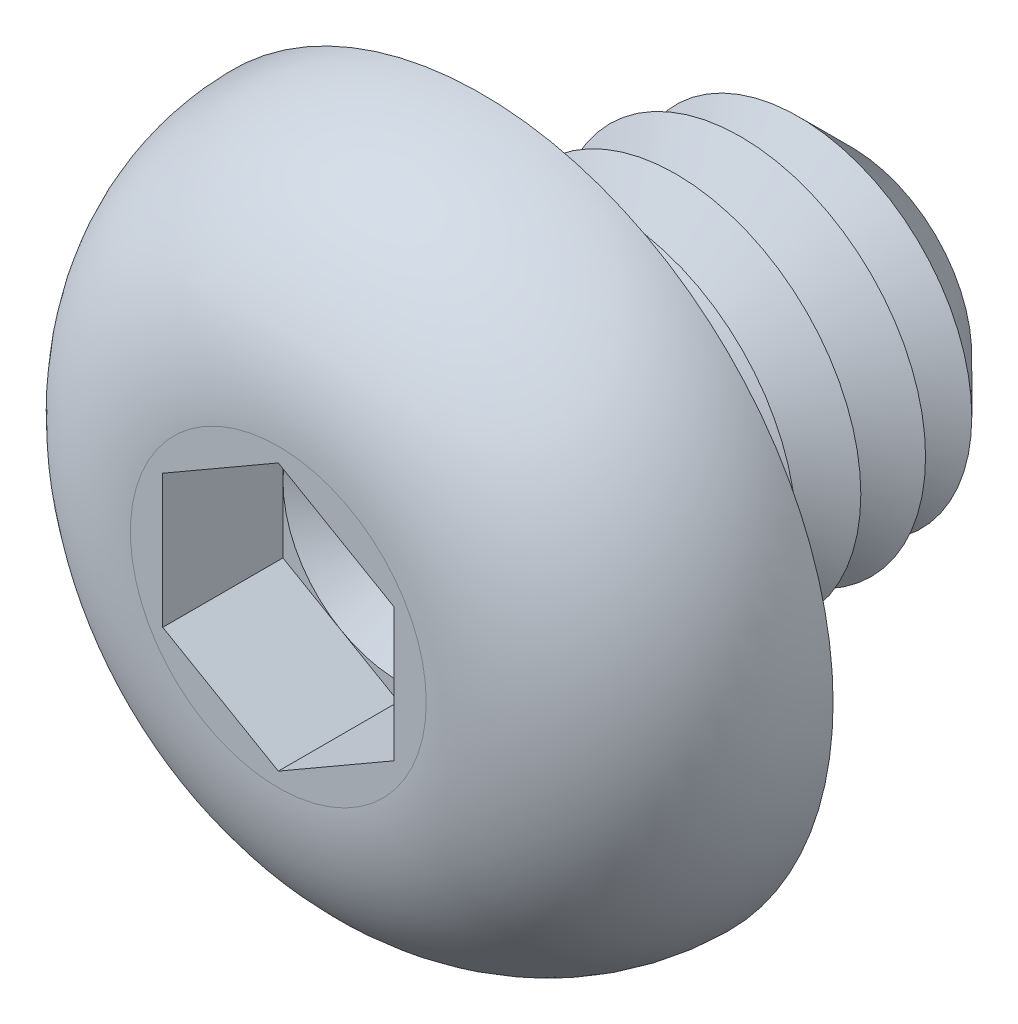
ISO-10303-21;
HEADER;
FILE_DESCRIPTION(('STEP AP214'),'2;1');
FILE_NAME('part.step','',(''),(''),'','','');
FILE_SCHEMA(('AUTOMOTIVE_DESIGN { 1 0 10303 214 1 1 1 1 }'));
ENDSEC;
DATA;
#1=APPLICATION_CONTEXT('core data for automotive mechanical design processes');
#2=APPLICATION_PROTOCOL_DEFINITION('international standard','automotive_design',2000,#1);
#3=PRODUCT_CONTEXT('',#1,'mechanical');
#4=PRODUCT('Part','Part','',(#3));
#5=PRODUCT_RELATED_PRODUCT_CATEGORY('part','',(#4));
#6=PRODUCT_DEFINITION_FORMATION('','',#4);
#7=PRODUCT_DEFINITION_CONTEXT('part definition',#1,'design');
#8=PRODUCT_DEFINITION('design','',#6,#7);
#9=PRODUCT_DEFINITION_SHAPE('','',#8);
#10=(LENGTH_UNIT() NAMED_UNIT(*) SI_UNIT(.MILLI.,.METRE.));
#11=(NAMED_UNIT(*) PLANE_ANGLE_UNIT() SI_UNIT($,.RADIAN.));
#12=(NAMED_UNIT(*) SI_UNIT($,.STERADIAN.) SOLID_ANGLE_UNIT());
#13=UNCERTAINTY_MEASURE_WITH_UNIT(LENGTH_MEASURE(1.E-05),#10,'distance_accuracy_value','');
#14=(GEOMETRIC_REPRESENTATION_CONTEXT(3) GLOBAL_UNCERTAINTY_ASSIGNED_CONTEXT((#13)) GLOBAL_UNIT_ASSIGNED_CONTEXT((#10,
#11,#12)) REPRESENTATION_CONTEXT('',''));
#15=CARTESIAN_POINT('',(0.,0.,0.));
#16=DIRECTION('',(0.,0.,1.));
#17=DIRECTION('',(1.,0.,0.));
#18=AXIS2_PLACEMENT_3D('',#15,#16,#17);
#19=CARTESIAN_POINT('',(0.,0.,0.900000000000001));
#20=DIRECTION('',(0.,0.,1.));
#21=DIRECTION('',(1.,0.,0.));
#22=AXIS2_PLACEMENT_3D('',#19,#20,#21);
#23=PLANE('',#22);
#24=CARTESIAN_POINT('',(0.,0.,0.900000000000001));
#25=DIRECTION('',(0.,0.,1.));
#26=DIRECTION('',(1.,0.,0.));
#27=AXIS2_PLACEMENT_3D('',#24,#25,#26);
#28=CIRCLE('',#27,1.25);
#29=CARTESIAN_POINT('',(1.25,0.,0.900000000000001));
#30=VERTEX_POINT('',#29);
#31=CARTESIAN_POINT('',(0.625,1.08253175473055,0.900000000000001));
#32=VERTEX_POINT('',#31);
#33=EDGE_CURVE('E117',#30,#32,#28,.T.);
#34=ORIENTED_EDGE('',*,*,#33,.F.);
#35=DIRECTION('',(0.,1.,0.));
#36=VECTOR('',#35,1.);
#37=CARTESIAN_POINT('',(1.25,-0.721687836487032,0.900000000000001));
#38=LINE('',#37,#36);
#39=CARTESIAN_POINT('',(1.25,0.721687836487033,0.900000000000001));
#40=VERTEX_POINT('',#39);
#41=EDGE_CURVE('E140',#30,#40,#38,.T.);
#42=ORIENTED_EDGE('',*,*,#41,.T.);
#43=DIRECTION('',(-0.866025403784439,0.5,0.));
#44=VECTOR('',#43,1.);
#45=CARTESIAN_POINT('',(1.25,0.721687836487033,0.900000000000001));
#46=LINE('',#45,#44);
#47=EDGE_CURVE('E135',#40,#32,#46,.T.);
#48=ORIENTED_EDGE('',*,*,#47,.T.);
#49=EDGE_LOOP('',(#34,#42,#48));
#50=FACE_BOUND('',#49,.T.);
#51=ADVANCED_FACE('F39',(#50),#23,.T.);
#52=CARTESIAN_POINT('',(0.,0.,0.900000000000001));
#53=DIRECTION('',(0.,0.,1.));
#54=DIRECTION('',(1.,0.,0.));
#55=AXIS2_PLACEMENT_3D('',#52,#53,#54);
#56=CIRCLE('',#55,1.25);
#57=CARTESIAN_POINT('',(-0.625,1.08253175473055,0.900000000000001));
#58=VERTEX_POINT('',#57);
#59=EDGE_CURVE('E11',#32,#58,#56,.T.);
#60=ORIENTED_EDGE('',*,*,#59,.F.);
#61=CARTESIAN_POINT('',(0.,1.44337567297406,0.900000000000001));
#62=VERTEX_POINT('',#61);
#63=EDGE_CURVE('E130',#32,#62,#46,.T.);
#64=ORIENTED_EDGE('',*,*,#63,.T.);
#65=DIRECTION('',(-0.866025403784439,-0.5,0.));
#66=VECTOR('',#65,1.);
#67=CARTESIAN_POINT('',(0.,1.44337567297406,0.900000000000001));
#68=LINE('',#67,#66);
#69=EDGE_CURVE('E132',#62,#58,#68,.T.);
#70=ORIENTED_EDGE('',*,*,#69,.T.);
#71=EDGE_LOOP('',(#60,#64,#70));
#72=FACE_BOUND('',#71,.T.);
#73=ADVANCED_FACE('F129',(#72),#23,.T.);
#74=CARTESIAN_POINT('',(-1.25,0.,0.900000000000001));
#75=VERTEX_POINT('',#74);
#76=EDGE_CURVE('E49',#58,#75,#56,.T.);
#77=ORIENTED_EDGE('',*,*,#76,.F.);
#78=CARTESIAN_POINT('',(-1.25,0.721687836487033,0.900000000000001));
#79=VERTEX_POINT('',#78);
#80=EDGE_CURVE('E143',#58,#79,#68,.T.);
#81=ORIENTED_EDGE('',*,*,#80,.T.);
#82=DIRECTION('',(0.,-1.,0.));
#83=VECTOR('',#82,1.);
#84=CARTESIAN_POINT('',(-1.25,0.721687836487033,0.900000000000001));
#85=LINE('',#84,#83);
#86=EDGE_CURVE('E154',#79,#75,#85,.T.);
#87=ORIENTED_EDGE('',*,*,#86,.T.);
#88=EDGE_LOOP('',(#77,#81,#87));
#89=FACE_BOUND('',#88,.T.);
#90=ADVANCED_FACE('F254',(#89),#23,.T.);
#91=CARTESIAN_POINT('',(-0.625,-1.08253175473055,0.900000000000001));
#92=VERTEX_POINT('',#91);
#93=EDGE_CURVE('E237',#75,#92,#56,.T.);
#94=ORIENTED_EDGE('',*,*,#93,.F.);
#95=CARTESIAN_POINT('',(-1.25,-0.721687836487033,0.900000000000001));
#96=VERTEX_POINT('',#95);
#97=EDGE_CURVE('E153',#75,#96,#85,.T.);
#98=ORIENTED_EDGE('',*,*,#97,.T.);
#99=DIRECTION('',(0.866025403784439,-0.5,0.));
#100=VECTOR('',#99,1.);
#101=CARTESIAN_POINT('',(-1.25,-0.721687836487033,0.900000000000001));
#102=LINE('',#101,#100);
#103=EDGE_CURVE('E159',#96,#92,#102,.T.);
#104=ORIENTED_EDGE('',*,*,#103,.T.);
#105=EDGE_LOOP('',(#94,#98,#104));
#106=FACE_BOUND('',#105,.T.);
#107=ADVANCED_FACE('F247',(#106),#23,.T.);
#108=CARTESIAN_POINT('',(0.625,-1.08253175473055,0.900000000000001));
#109=VERTEX_POINT('',#108);
#110=EDGE_CURVE('E56',#92,#109,#56,.T.);
#111=ORIENTED_EDGE('',*,*,#110,.F.);
#112=CARTESIAN_POINT('',(0.,-1.44337567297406,0.900000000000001));
#113=VERTEX_POINT('',#112);
#114=EDGE_CURVE('E158',#92,#113,#102,.T.);
#115=ORIENTED_EDGE('',*,*,#114,.T.);
#116=DIRECTION('',(0.866025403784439,0.5,0.));
#117=VECTOR('',#116,1.);
#118=CARTESIAN_POINT('',(0.,-1.44337567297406,0.900000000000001));
#119=LINE('',#118,#117);
#120=EDGE_CURVE('E164',#113,#109,#119,.T.);
#121=ORIENTED_EDGE('',*,*,#120,.T.);
#122=EDGE_LOOP('',(#111,#115,#121));
#123=FACE_BOUND('',#122,.T.);
#124=ADVANCED_FACE('F320',(#123),#23,.T.);
#125=CARTESIAN_POINT('',(0.,0.,-4.));
#126=DIRECTION('',(0.,0.,1.));
#127=DIRECTION('',(1.,0.,0.));
#128=AXIS2_PLACEMENT_3D('',#125,#126,#127);
#129=CYLINDRICAL_SURFACE('',#128,2.);
#130=CARTESIAN_POINT('',(0.,0.,-0.3));
#131=DIRECTION('',(0.,0.,1.));
#132=DIRECTION('',(1.,0.,0.));
#133=AXIS2_PLACEMENT_3D('',#130,#131,#132);
#134=CIRCLE('',#133,2.);
#135=CARTESIAN_POINT('',(2.,0.,-0.3));
#136=VERTEX_POINT('',#135);
#137=EDGE_CURVE('E222',#136,#136,#134,.F.);
#138=ORIENTED_EDGE('',*,*,#137,.T.);
#139=EDGE_LOOP('',(#138));
#140=FACE_BOUND('',#139,.T.);
#141=CARTESIAN_POINT('',(0.,0.,-0.699999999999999));
#142=DIRECTION('',(0.,0.,1.));
#143=DIRECTION('',(1.,0.,0.));
#144=AXIS2_PLACEMENT_3D('',#141,#142,#143);
#145=CIRCLE('',#144,2.);
#146=CARTESIAN_POINT('',(2.,0.,-0.699999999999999));
#147=VERTEX_POINT('',#146);
#148=EDGE_CURVE('E149',#147,#147,#145,.T.);
#149=ORIENTED_EDGE('',*,*,#148,.T.);
#150=EDGE_LOOP('',(#149));
#151=FACE_BOUND('',#150,.T.);
#152=ADVANCED_FACE('F304',(#140,#151),#129,.T.);
#153=CARTESIAN_POINT('',(0.,3.8,0.));
#154=DIRECTION('',(0.,0.,1.));
#155=DIRECTION('',(1.,0.,0.));
#156=AXIS2_PLACEMENT_3D('',#153,#154,#155);
#157=PLANE('',#156);
#158=CARTESIAN_POINT('',(0.,0.,0.));
#159=DIRECTION('',(0.,0.,1.));
#160=DIRECTION('',(1.,0.,0.));
#161=AXIS2_PLACEMENT_3D('',#158,#159,#160);
#162=CIRCLE('',#161,2.3);
#163=CARTESIAN_POINT('',(2.3,0.,0.));
#164=VERTEX_POINT('',#163);
#165=EDGE_CURVE('E230',#164,#164,#162,.T.);
#166=ORIENTED_EDGE('',*,*,#165,.T.);
#167=EDGE_LOOP('',(#166));
#168=FACE_BOUND('',#167,.T.);
#169=CARTESIAN_POINT('',(0.,0.,0.));
#170=DIRECTION('',(0.,0.,1.));
#171=DIRECTION('',(1.,0.,0.));
#172=AXIS2_PLACEMENT_3D('',#169,#170,#171);
#173=CIRCLE('',#172,3.8);
#174=CARTESIAN_POINT('',(3.8,0.,0.));
#175=VERTEX_POINT('',#174);
#176=EDGE_CURVE('E196',#175,#175,#173,.T.);
#177=ORIENTED_EDGE('',*,*,#176,.F.);
#178=EDGE_LOOP('',(#177));
#179=FACE_BOUND('',#178,.T.);
#180=ADVANCED_FACE('F350',(#168,#179),#157,.F.);
#181=CARTESIAN_POINT('',(0.,0.,2.2));
#182=DIRECTION('',(0.,0.,-1.));
#183=DIRECTION('',(-1.,0.,0.));
#184=AXIS2_PLACEMENT_3D('',#181,#182,#183);
#185=PLANE('',#184);
#186=DIRECTION('',(-0.866025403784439,-0.5,0.));
#187=VECTOR('',#186,1.);
#188=CARTESIAN_POINT('',(0.,1.44337567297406,2.2));
#189=LINE('',#188,#187);
#190=CARTESIAN_POINT('',(0.,1.44337567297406,2.2));
#191=VERTEX_POINT('',#190);
#192=CARTESIAN_POINT('',(-1.25,0.721687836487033,2.2));
#193=VERTEX_POINT('',#192);
#194=EDGE_CURVE('E174',#191,#193,#189,.T.);
#195=ORIENTED_EDGE('',*,*,#194,.F.);
#196=DIRECTION('',(-0.866025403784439,0.5,0.));
#197=VECTOR('',#196,1.);
#198=CARTESIAN_POINT('',(1.25,0.721687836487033,2.2));
#199=LINE('',#198,#197);
#200=CARTESIAN_POINT('',(1.25,0.721687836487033,2.2));
#201=VERTEX_POINT('',#200);
#202=EDGE_CURVE('E64',#201,#191,#199,.T.);
#203=ORIENTED_EDGE('',*,*,#202,.F.);
#204=DIRECTION('',(0.,1.,0.));
#205=VECTOR('',#204,1.);
#206=CARTESIAN_POINT('',(1.25,-0.721687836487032,2.2));
#207=LINE('',#206,#205);
#208=CARTESIAN_POINT('',(1.25,-0.721687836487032,2.2));
#209=VERTEX_POINT('',#208);
#210=EDGE_CURVE('E138',#209,#201,#207,.T.);
#211=ORIENTED_EDGE('',*,*,#210,.F.);
#212=DIRECTION('',(0.866025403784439,0.5,0.));
#213=VECTOR('',#212,1.);
#214=CARTESIAN_POINT('',(0.,-1.44337567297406,2.2));
#215=LINE('',#214,#213);
#216=CARTESIAN_POINT('',(0.,-1.44337567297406,2.2));
#217=VERTEX_POINT('',#216);
#218=EDGE_CURVE('E186',#217,#209,#215,.T.);
#219=ORIENTED_EDGE('',*,*,#218,.F.);
#220=DIRECTION('',(0.866025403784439,-0.5,0.));
#221=VECTOR('',#220,1.);
#222=CARTESIAN_POINT('',(-1.25,-0.721687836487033,2.2));
#223=LINE('',#222,#221);
#224=CARTESIAN_POINT('',(-1.25,-0.721687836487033,2.2));
#225=VERTEX_POINT('',#224);
#226=EDGE_CURVE('E182',#225,#217,#223,.T.);
#227=ORIENTED_EDGE('',*,*,#226,.F.);
#228=DIRECTION('',(0.,-1.,0.));
#229=VECTOR('',#228,1.);
#230=CARTESIAN_POINT('',(-1.25,0.721687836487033,2.2));
#231=LINE('',#230,#229);
#232=EDGE_CURVE('E178',#193,#225,#231,.T.);
#233=ORIENTED_EDGE('',*,*,#232,.F.);
#234=EDGE_LOOP('',(#195,#203,#211,#219,#227,#233));
#235=FACE_BOUND('',#234,.T.);
#236=CARTESIAN_POINT('',(0.,0.,2.2));
#237=DIRECTION('',(0.,0.,1.));
#238=DIRECTION('',(1.,0.,0.));
#239=AXIS2_PLACEMENT_3D('',#236,#237,#238);
#240=CIRCLE('',#239,1.6);
#241=CARTESIAN_POINT('',(1.6,0.,2.2));
#242=VERTEX_POINT('',#241);
#243=EDGE_CURVE('E214',#242,#242,#240,.T.);
#244=ORIENTED_EDGE('',*,*,#243,.T.);
#245=EDGE_LOOP('',(#244));
#246=FACE_BOUND('',#245,.T.);
#247=ADVANCED_FACE('F263',(#235,#246),#185,.F.);
#248=CARTESIAN_POINT('',(0.,0.,0.));
#249=DIRECTION('',(0.,0.,1.));
#250=DIRECTION('',(1.,0.,0.));
#251=AXIS2_PLACEMENT_3D('',#248,#249,#250);
#252=DEGENERATE_TOROIDAL_SURFACE('',#251,1.6,2.2,.T.);
#253=ORIENTED_EDGE('',*,*,#243,.F.);
#254=EDGE_LOOP('',(#253));
#255=FACE_BOUND('',#254,.T.);
#256=ORIENTED_EDGE('',*,*,#176,.T.);
#257=EDGE_LOOP('',(#256));
#258=FACE_BOUND('',#257,.T.);
#259=ADVANCED_FACE('F344',(#255,#258),#252,.T.);
#260=CARTESIAN_POINT('',(1.25,0.721687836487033,0.900000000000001));
#261=DIRECTION('',(0.5,0.866025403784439,0.));
#262=DIRECTION('',(-0.866025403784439,0.5,0.));
#263=AXIS2_PLACEMENT_3D('',#260,#261,#262);
#264=PLANE('',#263);
#265=ORIENTED_EDGE('',*,*,#202,.T.);
#266=DIRECTION('',(0.,0.,1.));
#267=VECTOR('',#266,1.);
#268=CARTESIAN_POINT('',(0.,1.44337567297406,0.900000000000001));
#269=LINE('',#268,#267);
#270=EDGE_CURVE('E136',#62,#191,#269,.T.);
#271=ORIENTED_EDGE('',*,*,#270,.F.);
#272=ORIENTED_EDGE('',*,*,#63,.F.);
#273=ORIENTED_EDGE('',*,*,#47,.F.);
#274=DIRECTION('',(0.,0.,1.));
#275=VECTOR('',#274,1.);
#276=CARTESIAN_POINT('',(1.25,0.721687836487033,0.900000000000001));
#277=LINE('',#276,#275);
#278=EDGE_CURVE('E193',#40,#201,#277,.T.);
#279=ORIENTED_EDGE('',*,*,#278,.T.);
#280=EDGE_LOOP('',(#265,#271,#272,#273,#279));
#281=FACE_BOUND('',#280,.T.);
#282=ADVANCED_FACE('F134',(#281),#264,.F.);
#283=CARTESIAN_POINT('',(1.25,-0.721687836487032,0.900000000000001));
#284=DIRECTION('',(1.,0.,0.));
#285=DIRECTION('',(0.,1.,0.));
#286=AXIS2_PLACEMENT_3D('',#283,#284,#285);
#287=PLANE('',#286);
#288=ORIENTED_EDGE('',*,*,#210,.T.);
#289=ORIENTED_EDGE('',*,*,#278,.F.);
#290=ORIENTED_EDGE('',*,*,#41,.F.);
#291=CARTESIAN_POINT('',(1.25,-0.721687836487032,0.900000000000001));
#292=VERTEX_POINT('',#291);
#293=EDGE_CURVE('E168',#292,#30,#38,.T.);
#294=ORIENTED_EDGE('',*,*,#293,.F.);
#295=DIRECTION('',(0.,0.,1.));
#296=VECTOR('',#295,1.);
#297=CARTESIAN_POINT('',(1.25,-0.721687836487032,0.900000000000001));
#298=LINE('',#297,#296);
#299=EDGE_CURVE('E197',#292,#209,#298,.T.);
#300=ORIENTED_EDGE('',*,*,#299,.T.);
#301=EDGE_LOOP('',(#288,#289,#290,#294,#300));
#302=FACE_BOUND('',#301,.T.);
#303=ADVANCED_FACE('F328',(#302),#287,.F.);
#304=CARTESIAN_POINT('',(0.,-1.44337567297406,0.900000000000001));
#305=DIRECTION('',(0.5,-0.866025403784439,0.));
#306=DIRECTION('',(0.866025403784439,0.5,0.));
#307=AXIS2_PLACEMENT_3D('',#304,#305,#306);
#308=PLANE('',#307);
#309=ORIENTED_EDGE('',*,*,#218,.T.);
#310=ORIENTED_EDGE('',*,*,#299,.F.);
#311=EDGE_CURVE('E163',#109,#292,#119,.T.);
#312=ORIENTED_EDGE('',*,*,#311,.F.);
#313=ORIENTED_EDGE('',*,*,#120,.F.);
#314=DIRECTION('',(0.,0.,1.));
#315=VECTOR('',#314,1.);
#316=CARTESIAN_POINT('',(0.,-1.44337567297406,0.900000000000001));
#317=LINE('',#316,#315);
#318=EDGE_CURVE('E200',#113,#217,#317,.T.);
#319=ORIENTED_EDGE('',*,*,#318,.T.);
#320=EDGE_LOOP('',(#309,#310,#312,#313,#319));
#321=FACE_BOUND('',#320,.T.);
#322=ADVANCED_FACE('F331',(#321),#308,.F.);
#323=CARTESIAN_POINT('',(-1.25,-0.721687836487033,0.900000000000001));
#324=DIRECTION('',(-0.5,-0.866025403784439,0.));
#325=DIRECTION('',(0.866025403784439,-0.5,0.));
#326=AXIS2_PLACEMENT_3D('',#323,#324,#325);
#327=PLANE('',#326);
#328=ORIENTED_EDGE('',*,*,#226,.T.);
#329=ORIENTED_EDGE('',*,*,#318,.F.);
#330=ORIENTED_EDGE('',*,*,#114,.F.);
#331=ORIENTED_EDGE('',*,*,#103,.F.);
#332=DIRECTION('',(0.,0.,1.));
#333=VECTOR('',#332,1.);
#334=CARTESIAN_POINT('',(-1.25,-0.721687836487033,0.900000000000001));
#335=LINE('',#334,#333);
#336=EDGE_CURVE('E203',#96,#225,#335,.T.);
#337=ORIENTED_EDGE('',*,*,#336,.T.);
#338=EDGE_LOOP('',(#328,#329,#330,#331,#337));
#339=FACE_BOUND('',#338,.T.);
#340=ADVANCED_FACE('F268',(#339),#327,.F.);
#341=CARTESIAN_POINT('',(-1.25,0.721687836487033,0.900000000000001));
#342=DIRECTION('',(-1.,0.,0.));
#343=DIRECTION('',(0.,0.,1.));
#344=AXIS2_PLACEMENT_3D('',#341,#342,#343);
#345=PLANE('',#344);
#346=ORIENTED_EDGE('',*,*,#232,.T.);
#347=ORIENTED_EDGE('',*,*,#336,.F.);
#348=ORIENTED_EDGE('',*,*,#97,.F.);
#349=ORIENTED_EDGE('',*,*,#86,.F.);
#350=DIRECTION('',(0.,0.,1.));
#351=VECTOR('',#350,1.);
#352=CARTESIAN_POINT('',(-1.25,0.721687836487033,0.900000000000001));
#353=LINE('',#352,#351);
#354=EDGE_CURVE('E206',#79,#193,#353,.T.);
#355=ORIENTED_EDGE('',*,*,#354,.T.);
#356=EDGE_LOOP('',(#346,#347,#348,#349,#355));
#357=FACE_BOUND('',#356,.T.);
#358=ADVANCED_FACE('F252',(#357),#345,.F.);
#359=CARTESIAN_POINT('',(0.,1.44337567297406,0.900000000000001));
#360=DIRECTION('',(-0.5,0.866025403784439,0.));
#361=DIRECTION('',(-0.866025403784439,-0.5,0.));
#362=AXIS2_PLACEMENT_3D('',#359,#360,#361);
#363=PLANE('',#362);
#364=ORIENTED_EDGE('',*,*,#194,.T.);
#365=ORIENTED_EDGE('',*,*,#354,.F.);
#366=ORIENTED_EDGE('',*,*,#80,.F.);
#367=ORIENTED_EDGE('',*,*,#69,.F.);
#368=ORIENTED_EDGE('',*,*,#270,.T.);
#369=EDGE_LOOP('',(#364,#365,#366,#367,#368));
#370=FACE_BOUND('',#369,.T.);
#371=ADVANCED_FACE('F257',(#370),#363,.F.);
#372=EDGE_CURVE('E43',#109,#30,#56,.T.);
#373=ORIENTED_EDGE('',*,*,#372,.F.);
#374=ORIENTED_EDGE('',*,*,#311,.T.);
#375=ORIENTED_EDGE('',*,*,#293,.T.);
#376=EDGE_LOOP('',(#373,#374,#375));
#377=FACE_BOUND('',#376,.T.);
#378=ADVANCED_FACE('F309',(#377),#23,.T.);
#379=CARTESIAN_POINT('',(0.,0.,-0.699999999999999));
#380=DIRECTION('',(0.,0.,1.));
#381=DIRECTION('',(1.,0.,0.));
#382=AXIS2_PLACEMENT_3D('',#379,#380,#381);
#383=CONICAL_SURFACE('',#382,2.,1.04719755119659);
#384=CARTESIAN_POINT('',(0.,0.,-1.05));
#385=DIRECTION('',(0.,0.,1.));
#386=DIRECTION('',(1.,0.,0.));
#387=AXIS2_PLACEMENT_3D('',#384,#385,#386);
#388=CIRCLE('',#387,1.3937822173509);
#389=CARTESIAN_POINT('',(1.3937822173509,0.,-1.05));
#390=VERTEX_POINT('',#389);
#391=EDGE_CURVE('E294',#390,#390,#388,.T.);
#392=ORIENTED_EDGE('',*,*,#391,.T.);
#393=EDGE_LOOP('',(#392));
#394=FACE_BOUND('',#393,.T.);
#395=ORIENTED_EDGE('',*,*,#148,.F.);
#396=EDGE_LOOP('',(#395));
#397=FACE_BOUND('',#396,.T.);
#398=ADVANCED_FACE('F306',(#394,#397),#383,.T.);
#399=CARTESIAN_POINT('',(0.,0.,-1.05));
#400=DIRECTION('',(0.,0.,-1.));
#401=DIRECTION('',(-1.,0.,0.));
#402=AXIS2_PLACEMENT_3D('',#399,#400,#401);
#403=CONICAL_SURFACE('',#402,1.3937822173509,1.0471975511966);
#404=CARTESIAN_POINT('',(0.,0.,-1.4));
#405=DIRECTION('',(0.,0.,1.));
#406=DIRECTION('',(1.,0.,0.));
#407=AXIS2_PLACEMENT_3D('',#404,#405,#406);
#408=CIRCLE('',#407,2.);
#409=CARTESIAN_POINT('',(2.,0.,-1.4));
#410=VERTEX_POINT('',#409);
#411=EDGE_CURVE('E292',#410,#410,#408,.T.);
#412=ORIENTED_EDGE('',*,*,#411,.T.);
#413=EDGE_LOOP('',(#412));
#414=FACE_BOUND('',#413,.T.);
#415=ORIENTED_EDGE('',*,*,#391,.F.);
#416=EDGE_LOOP('',(#415));
#417=FACE_BOUND('',#416,.T.);
#418=ADVANCED_FACE('F308',(#414,#417),#403,.T.);
#419=CARTESIAN_POINT('',(0.,0.,-1.4));
#420=DIRECTION('',(0.,0.,1.));
#421=DIRECTION('',(1.,0.,0.));
#422=AXIS2_PLACEMENT_3D('',#419,#420,#421);
#423=CONICAL_SURFACE('',#422,2.,1.04719755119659);
#424=CARTESIAN_POINT('',(0.,0.,-1.75));
#425=DIRECTION('',(0.,0.,1.));
#426=DIRECTION('',(1.,0.,0.));
#427=AXIS2_PLACEMENT_3D('',#424,#425,#426);
#428=CIRCLE('',#427,1.3937822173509);
#429=CARTESIAN_POINT('',(1.3937822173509,0.,-1.75));
#430=VERTEX_POINT('',#429);
#431=EDGE_CURVE('E289',#430,#430,#428,.T.);
#432=ORIENTED_EDGE('',*,*,#431,.T.);
#433=EDGE_LOOP('',(#432));
#434=FACE_BOUND('',#433,.T.);
#435=ORIENTED_EDGE('',*,*,#411,.F.);
#436=EDGE_LOOP('',(#435));
#437=FACE_BOUND('',#436,.T.);
#438=ADVANCED_FACE('F315',(#434,#437),#423,.T.);
#439=CARTESIAN_POINT('',(0.,0.,-1.75));
#440=DIRECTION('',(0.,0.,-1.));
#441=DIRECTION('',(-1.,0.,0.));
#442=AXIS2_PLACEMENT_3D('',#439,#440,#441);
#443=CONICAL_SURFACE('',#442,1.3937822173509,1.0471975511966);
#444=CARTESIAN_POINT('',(0.,0.,-2.1));
#445=DIRECTION('',(0.,0.,1.));
#446=DIRECTION('',(1.,0.,0.));
#447=AXIS2_PLACEMENT_3D('',#444,#445,#446);
#448=CIRCLE('',#447,2.);
#449=CARTESIAN_POINT('',(2.,0.,-2.1));
#450=VERTEX_POINT('',#449);
#451=EDGE_CURVE('E285',#450,#450,#448,.T.);
#452=ORIENTED_EDGE('',*,*,#451,.T.);
#453=EDGE_LOOP('',(#452));
#454=FACE_BOUND('',#453,.T.);
#455=ORIENTED_EDGE('',*,*,#431,.F.);
#456=EDGE_LOOP('',(#455));
#457=FACE_BOUND('',#456,.T.);
#458=ADVANCED_FACE('F383',(#454,#457),#443,.T.);
#459=CARTESIAN_POINT('',(0.,0.,-2.1));
#460=DIRECTION('',(0.,0.,1.));
#461=DIRECTION('',(1.,0.,0.));
#462=AXIS2_PLACEMENT_3D('',#459,#460,#461);
#463=CONICAL_SURFACE('',#462,2.,1.04719755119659);
#464=CARTESIAN_POINT('',(0.,0.,-2.45));
#465=DIRECTION('',(0.,0.,1.));
#466=DIRECTION('',(1.,0.,0.));
#467=AXIS2_PLACEMENT_3D('',#464,#465,#466);
#468=CIRCLE('',#467,1.3937822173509);
#469=CARTESIAN_POINT('',(1.3937822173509,0.,-2.45));
#470=VERTEX_POINT('',#469);
#471=EDGE_CURVE('E226',#470,#470,#468,.T.);
#472=ORIENTED_EDGE('',*,*,#471,.T.);
#473=EDGE_LOOP('',(#472));
#474=FACE_BOUND('',#473,.T.);
#475=ORIENTED_EDGE('',*,*,#451,.F.);
#476=EDGE_LOOP('',(#475));
#477=FACE_BOUND('',#476,.T.);
#478=ADVANCED_FACE('F379',(#474,#477),#463,.T.);
#479=CARTESIAN_POINT('',(0.,0.,-2.45));
#480=DIRECTION('',(0.,0.,-1.));
#481=DIRECTION('',(-1.,0.,0.));
#482=AXIS2_PLACEMENT_3D('',#479,#480,#481);
#483=CONICAL_SURFACE('',#482,1.3937822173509,1.0471975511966);
#484=CARTESIAN_POINT('',(0.,0.,-2.8));
#485=DIRECTION('',(0.,0.,1.));
#486=DIRECTION('',(1.,0.,0.));
#487=AXIS2_PLACEMENT_3D('',#484,#485,#486);
#488=CIRCLE('',#487,2.);
#489=CARTESIAN_POINT('',(2.,0.,-2.8));
#490=VERTEX_POINT('',#489);
#491=EDGE_CURVE('E227',#490,#490,#488,.T.);
#492=ORIENTED_EDGE('',*,*,#491,.T.);
#493=EDGE_LOOP('',(#492));
#494=FACE_BOUND('',#493,.T.);
#495=ORIENTED_EDGE('',*,*,#471,.F.);
#496=EDGE_LOOP('',(#495));
#497=FACE_BOUND('',#496,.T.);
#498=ADVANCED_FACE('F374',(#494,#497),#483,.T.);
#499=CARTESIAN_POINT('',(0.,0.,-2.8));
#500=DIRECTION('',(0.,0.,1.));
#501=DIRECTION('',(1.,0.,0.));
#502=AXIS2_PLACEMENT_3D('',#499,#500,#501);
#503=CONICAL_SURFACE('',#502,2.,1.04719755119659);
#504=CARTESIAN_POINT('',(0.,0.,-3.15));
#505=DIRECTION('',(0.,0.,1.));
#506=DIRECTION('',(1.,0.,0.));
#507=AXIS2_PLACEMENT_3D('',#504,#505,#506);
#508=CIRCLE('',#507,1.3937822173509);
#509=CARTESIAN_POINT('',(1.3937822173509,0.,-3.15));
#510=VERTEX_POINT('',#509);
#511=EDGE_CURVE('E124',#510,#510,#508,.T.);
#512=ORIENTED_EDGE('',*,*,#511,.T.);
#513=EDGE_LOOP('',(#512));
#514=FACE_BOUND('',#513,.T.);
#515=ORIENTED_EDGE('',*,*,#491,.F.);
#516=EDGE_LOOP('',(#515));
#517=FACE_BOUND('',#516,.T.);
#518=ADVANCED_FACE('F369',(#514,#517),#503,.T.);
#519=CARTESIAN_POINT('',(0.,0.,-3.15));
#520=DIRECTION('',(0.,0.,-1.));
#521=DIRECTION('',(-1.,0.,0.));
#522=AXIS2_PLACEMENT_3D('',#519,#520,#521);
#523=CONICAL_SURFACE('',#522,1.3937822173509,1.0471975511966);
#524=CARTESIAN_POINT('',(0.,0.,-3.42679491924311));
#525=DIRECTION('',(0.,0.,-1.));
#526=DIRECTION('',(-1.,0.,0.));
#527=AXIS2_PLACEMENT_3D('',#524,#525,#526);
#528=CIRCLE('',#527,1.87320508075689);
#529=CARTESIAN_POINT('',(-1.87320508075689,0.,-3.42679491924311));
#530=VERTEX_POINT('',#529);
#531=EDGE_CURVE('E223',#530,#530,#528,.T.);
#532=ORIENTED_EDGE('',*,*,#531,.F.);
#533=EDGE_LOOP('',(#532));
#534=FACE_BOUND('',#533,.T.);
#535=ORIENTED_EDGE('',*,*,#511,.F.);
#536=EDGE_LOOP('',(#535));
#537=FACE_BOUND('',#536,.T.);
#538=ADVANCED_FACE('F361',(#534,#537),#523,.T.);
#539=CARTESIAN_POINT('',(0.,0.,-4.));
#540=DIRECTION('',(0.,0.,-1.));
#541=DIRECTION('',(-1.,0.,0.));
#542=AXIS2_PLACEMENT_3D('',#539,#540,#541);
#543=PLANE('',#542);
#544=CARTESIAN_POINT('',(0.,0.,-4.));
#545=DIRECTION('',(0.,0.,-1.));
#546=DIRECTION('',(-1.,0.,0.));
#547=AXIS2_PLACEMENT_3D('',#544,#545,#546);
#548=CIRCLE('',#547,1.3);
#549=CARTESIAN_POINT('',(-1.3,0.,-4.));
#550=VERTEX_POINT('',#549);
#551=EDGE_CURVE('E218',#550,#550,#548,.T.);
#552=ORIENTED_EDGE('',*,*,#551,.T.);
#553=EDGE_LOOP('',(#552));
#554=FACE_BOUND('',#553,.T.);
#555=ADVANCED_FACE('F354',(#554),#543,.T.);
#556=CARTESIAN_POINT('',(0.,0.,-4.));
#557=DIRECTION('',(0.,0.,1.));
#558=DIRECTION('',(1.,0.,0.));
#559=AXIS2_PLACEMENT_3D('',#556,#557,#558);
#560=CONICAL_SURFACE('',#559,1.3,0.785398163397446);
#561=ORIENTED_EDGE('',*,*,#551,.F.);
#562=EDGE_LOOP('',(#561));
#563=FACE_BOUND('',#562,.T.);
#564=ORIENTED_EDGE('',*,*,#531,.T.);
#565=EDGE_LOOP('',(#564));
#566=FACE_BOUND('',#565,.T.);
#567=ADVANCED_FACE('F352',(#563,#566),#560,.T.);
#568=CARTESIAN_POINT('',(0.,0.,-0.3));
#569=DIRECTION('',(0.,0.,1.));
#570=DIRECTION('',(1.,0.,0.));
#571=AXIS2_PLACEMENT_3D('',#568,#569,#570);
#572=TOROIDAL_SURFACE('',#571,2.3,0.3);
#573=ORIENTED_EDGE('',*,*,#165,.F.);
#574=EDGE_LOOP('',(#573));
#575=FACE_BOUND('',#574,.T.);
#576=ORIENTED_EDGE('',*,*,#137,.F.);
#577=EDGE_LOOP('',(#576));
#578=FACE_BOUND('',#577,.T.);
#579=ADVANCED_FACE('F41',(#575,#578),#572,.F.);
#580=CARTESIAN_POINT('',(0.,0.,0.900000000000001));
#581=DIRECTION('',(0.,0.,1.));
#582=DIRECTION('',(1.,0.,0.));
#583=AXIS2_PLACEMENT_3D('',#580,#581,#582);
#584=CONICAL_SURFACE('',#583,1.25,1.0471975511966);
#585=CARTESIAN_POINT('',(0.,0.,0.178312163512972));
#586=VERTEX_POINT('',#585);
#587=VERTEX_LOOP('',#586);
#588=FACE_BOUND('',#587,.T.);
#589=ORIENTED_EDGE('',*,*,#33,.T.);
#590=ORIENTED_EDGE('',*,*,#59,.T.);
#591=ORIENTED_EDGE('',*,*,#76,.T.);
#592=ORIENTED_EDGE('',*,*,#93,.T.);
#593=ORIENTED_EDGE('',*,*,#110,.T.);
#594=ORIENTED_EDGE('',*,*,#372,.T.);
#595=EDGE_LOOP('',(#589,#590,#591,#592,#593,#594));
#596=FACE_BOUND('',#595,.T.);
#597=ADVANCED_FACE('F113',(#588,#596),#584,.F.);
#598=CLOSED_SHELL('',(#51,#73,#90,#107,#124,#152,#180,#247,#259,#282,#303,#322,#340,#358,#371,
#378,#398,#418,#438,#458,#478,#498,#518,#538,#555,#567,#579,#597));
#599=MANIFOLD_SOLID_BREP('B2',#598);
#600=ADVANCED_BREP_SHAPE_REPRESENTATION('',(#18,#599),#14);
#601=SHAPE_DEFINITION_REPRESENTATION(#9,#600);
ENDSEC;
END-ISO-10303-21;
